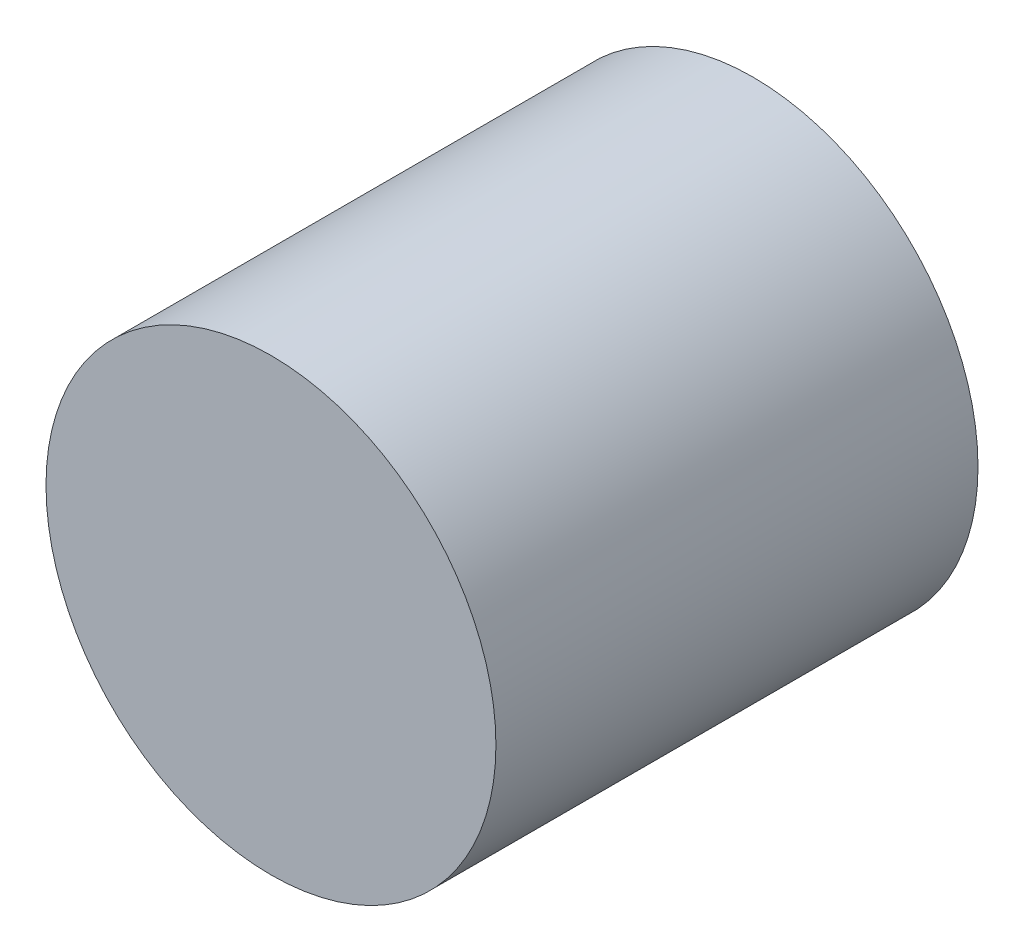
from build123d import *

# Parameters (mm, degrees)
SZKIC1_R                    = 70
DODANIE_WYCI_GNI_CIE1_DEPTH = 150


with BuildPart() as part:
    # Szkic1 → Dodanie-wyci_gni_cie1 (new body)
    with BuildSketch(Plane.XY):
        Circle(SZKIC1_R)
    extrude(amount=DODANIE_WYCI_GNI_CIE1_DEPTH)


solid = part.part
